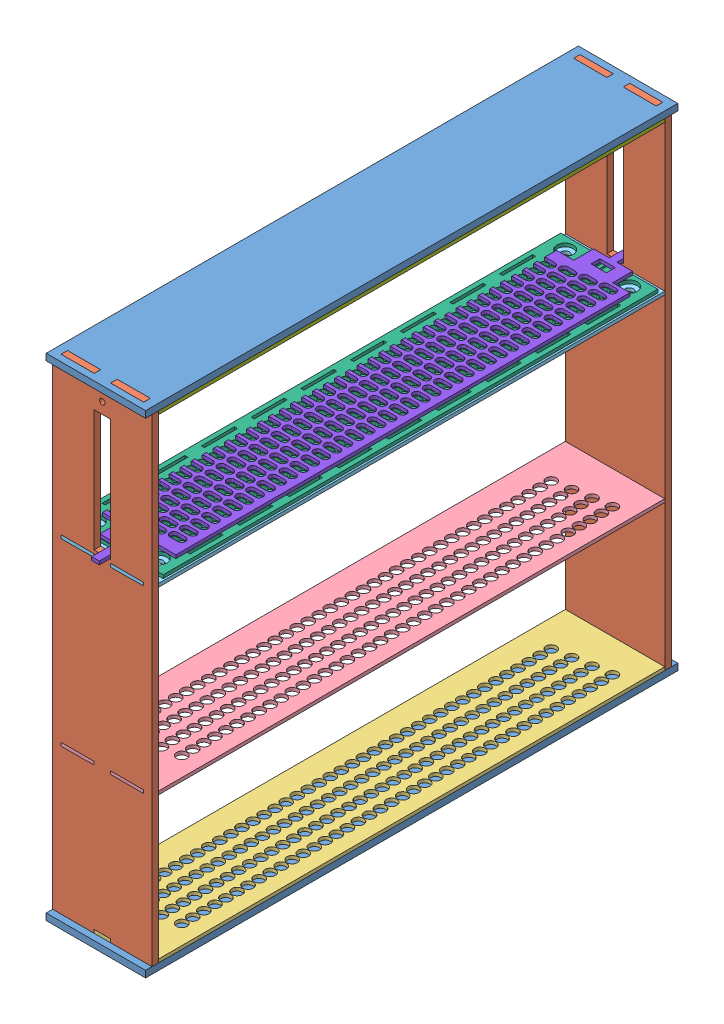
SolidWorks assembly Ensamble.SLDASM, configuration Predeterminado (file format 9000). Lengths in mm.
Overall size (90 445 490.4).
10 component instances, 8 part files, 26 mates.
Components (placement in the parent):
- Medidas Base-1: Medidas Base.SLDPRT [Predeterminado] at (-52.6732 -3.6234 723) size (90 6 482)
- Paredes-2: Paredes.SLDPRT [Predeterminado] at (-52.6732 2.3766 246.8) x (1 0 0) z (0 -1 0) size (90 6 445)
- Guias inferior-1: Guias inferior.SLDPRT [Predeterminado] at (-52.6732 2.3766 711.2) size (90 3 470.4)
- Paredes-3: Paredes.SLDPRT [Predeterminado] at (-52.6732 2.3766 711.2) x (1 0 0) z (0 -1 0) size (90 6 445)
- Guias superior-1: Guias superior.SLDPRT [Predeterminado] at (-52.6732 134.1766 711.2) size (90 3 470.4)
- Soporte Balines-1: Soporte Balines.SLDPRT [Predeterminado] at (-52.6732 296.9766 711.2) size (90 3 470.4)
- 160 Seguros-1: 160 Seguros.SLDPRT [Predeterminado] at (-51.6732 300.6183 706) size (88 3 448)
- Guia rodamientos-1: Guia rodamientos.SLDPRT [Predeterminado] at (-40.6732 432.3766 278) size (90 3 470.4)
- Medidas Base-2: Medidas Base.SLDPRT [Predeterminado] at (-52.6732 435.3766 723) size (90 6 482)
- Marco Bloqueo-1: Marco Bloqueo.SLDPRT [Predeterminado] at (-37.1055 303.6183 687.6) size (66.5 3 490.4)
Mates (geometry in assembly coordinates):
- Coincidente4: coincident anti-aligned: plane of Medidas Base-1 through (-52.6732 2.3766 723) normal (0 1 0); plane of Guias inferior-1 through (-52.6732 2.3766 711.2) normal (0 -1 0)
- Coincidente5: coincident aligned: plane of Medidas Base-1 through (37.3268 2.3766 723) normal (1 0 0); plane of Guias inferior-1 through (37.3268 5.3766 711.2) normal (1 0 0)
- Coincidente6: coincident aligned: plane of Medidas Base-1 through (29.6268 2.3766 252.8) normal (0 0 -1); plane of Guias inferior-1 through (-0.1732 5.3766 252.8) normal (0 0 -1)
- Coincidente8: coincident aligned: plane of Medidas Base-1 through (37.3268 2.3766 723) normal (1 0 0); plane of Paredes-2 through (37.3268 2.3766 252.8) normal (1 0 0)
- Coincidente10: coincident anti-aligned: plane of Medidas Base-1 through (29.6268 2.3766 711.2) normal (0 0 1); plane of Paredes-3 through (-52.6732 2.3766 711.2) normal (0 0 -1)
- Coincidente11: coincident aligned: plane of Medidas Base-1 through (37.3268 2.3766 723) normal (1 0 0); plane of Paredes-3 through (37.3268 2.3766 717.2) normal (1 0 0)
- Coincidente12: coincident anti-aligned: plane of Medidas Base-1 through (29.6268 2.3766 252.8) normal (0 0 -1); plane of Paredes-2 through (-52.6732 2.3766 252.8) normal (0 0 1)
- Coincidente13: coincident anti-aligned: plane of Paredes-3 through (-52.6732 2.3766 711.2) normal (0 0 -1); plane of Guias superior-1 through (-15.1732 137.1766 711.2) normal (0 0 1)
- Coincidente14: coincident aligned: plane of Paredes-3 through (37.3268 2.3766 717.2) normal (1 0 0); plane of Guias superior-1 through (37.3268 137.1766 711.2) normal (1 0 0)
- Coincidente15: coincident anti-aligned: plane of Paredes-3 through (29.6268 137.1766 717.2) normal (0 -1 0); plane of Guias superior-1 through (-52.6732 137.1766 711.2) normal (0 1 0)
- Coincidente16: coincident anti-aligned: plane of Paredes-2 through (-52.6732 2.3766 252.8) normal (0 0 1); plane of Soporte Balines-1 through (-15.1732 299.9766 252.8) normal (0 0 -1)
- Coincidente17: coincident aligned: plane of Paredes-2 through (-52.6732 2.3766 252.8) normal (-1 0 0); plane of Soporte Balines-1 through (-52.6732 299.9766 711.2) normal (-1 0 0)
- Coincidente18: coincident anti-aligned: plane of Paredes-2 through (-44.9732 299.9766 252.8) normal (0 -1 0); plane of Soporte Balines-1 through (-52.6732 299.9766 711.2) normal (0 1 0)
- Concéntrica1: concentric aligned: cylinder of Soporte Balines-1 through (21.3268 299.9766 695) axis (0 -1 0) radius 3.9; cylinder of 160 Seguros-1 through (21.3268 303.6183 695) axis (0 -1 0) radius 7.4
- Concéntrica2: concentric aligned: cylinder of Soporte Balines-1 through (21.3268 299.9766 269) axis (0 -1 0) radius 3.9; cylinder of 160 Seguros-1 through (21.3268 303.6183 269) axis (0 -1 0) radius 7.4
- Coincidente19: coincident anti-aligned: plane of Paredes-3 through (-52.6732 2.3766 711.2) normal (0 0 -1); plane of Guia rodamientos-1 through (-52.6732 435.3766 711.2) normal (0 0 1)
- Coincidente20: coincident aligned: plane of Paredes-3 through (37.3268 2.3766 717.2) normal (1 0 0); plane of Guia rodamientos-1 through (37.3268 435.3766 711.2) normal (1 0 0)
- Coincidente22: coincident aligned: plane of Paredes-3 through (37.3268 2.3766 717.2) normal (1 0 0); plane of Medidas Base-2 through (37.3268 441.3766 723) normal (1 0 0)
- Coincidente24: coincident anti-aligned: plane of Paredes-3 through (-52.6732 2.3766 711.2) normal (0 0 -1); plane of Medidas Base-2 through (29.6268 441.3766 711.2) normal (0 0 1)
- Coincidente25: coincident aligned: plane of Paredes-3 through (29.8268 441.3766 717.2) normal (0 1 0); plane of Medidas Base-2 through (-52.6732 441.3766 723) normal (0 1 0)
- Coincidente26: coincident anti-aligned: plane of Guias inferior-1 through (-52.6732 5.3766 711.2) normal (0 1 0); plane of Paredes-3 through (-15.1732 5.3766 717.2) normal (0 -1 0)
- Coincidente27: coincident anti-aligned: plane of Guia rodamientos-1 through (-40.6732 435.3766 278) normal (0 1 0); plane of Medidas Base-2 through (-52.6732 435.3766 723) normal (0 -1 0)
- Coincidente28: coincident anti-aligned: plane of Paredes-3 through (29.6268 299.9766 717.2) normal (0 -1 0); plane of Soporte Balines-1 through (-52.6732 299.9766 711.2) normal (0 1 0)
- Coincidente29: coincident anti-aligned: plane of 160 Seguros-1 through (-51.6732 303.6183 706) normal (0 1 0); plane of Marco Bloqueo-1 through (-35.3055 303.6183 680.3) normal (0 -1 0)
- Tangente1: tangent: cylinder of 160 Seguros-1 through (21.3268 303.6183 269) axis (0 -1 0) radius 7.4; line of Marco Bloqueo-1 through (29.3945 306.6183 276.4) axis (-1 0 0)
- Tangente2: tangent anti-aligned: cylinder of 160 Seguros-1 through (21.3268 303.6183 695) axis (0 -1 0) radius 7.4; plane of Marco Bloqueo-1 through (13.7945 306.6183 687.6) normal (0 0 1)
